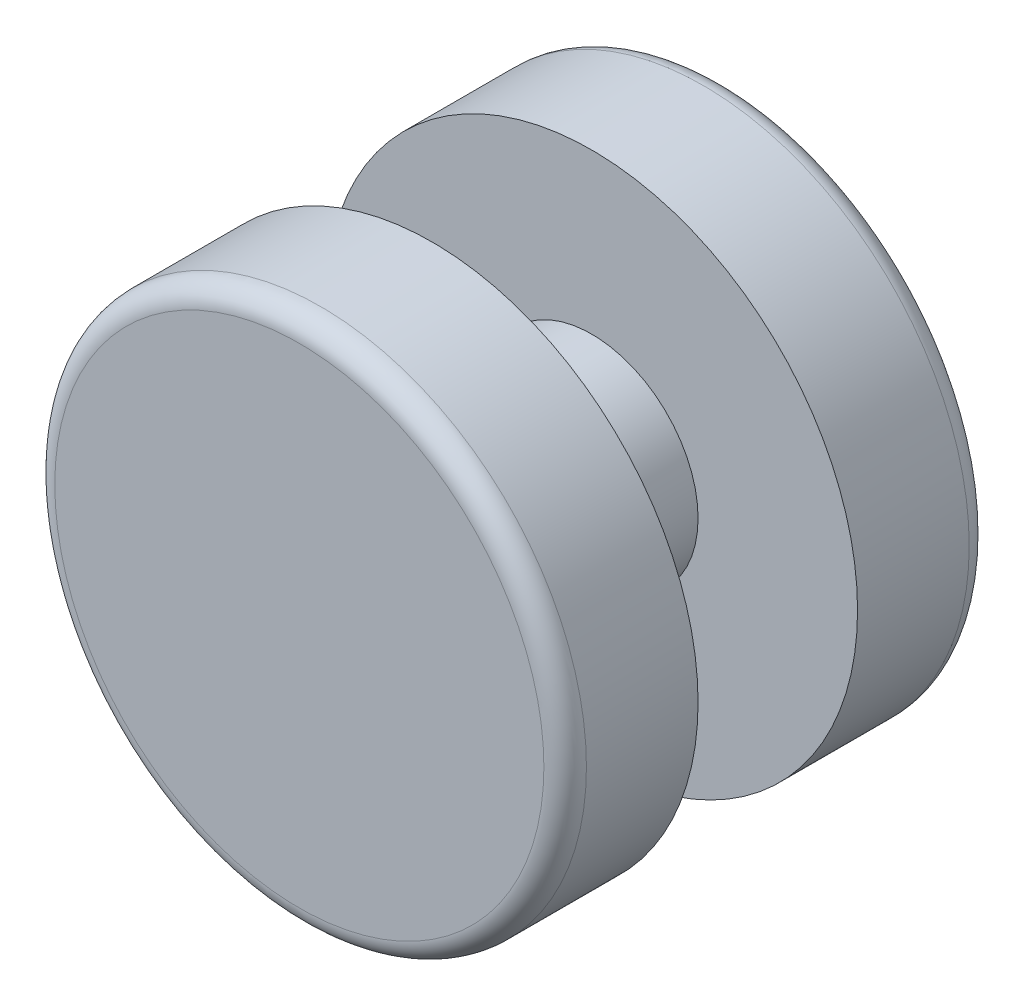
ISO-10303-21;
HEADER;
FILE_DESCRIPTION(('STEP AP214'),'2;1');
FILE_NAME('part.step','',(''),(''),'','','');
FILE_SCHEMA(('AUTOMOTIVE_DESIGN { 1 0 10303 214 1 1 1 1 }'));
ENDSEC;
DATA;
#1=APPLICATION_CONTEXT('core data for automotive mechanical design processes');
#2=APPLICATION_PROTOCOL_DEFINITION('international standard','automotive_design',2000,#1);
#3=PRODUCT_CONTEXT('',#1,'mechanical');
#4=PRODUCT('Part','Part','',(#3));
#5=PRODUCT_RELATED_PRODUCT_CATEGORY('part','',(#4));
#6=PRODUCT_DEFINITION_FORMATION('','',#4);
#7=PRODUCT_DEFINITION_CONTEXT('part definition',#1,'design');
#8=PRODUCT_DEFINITION('design','',#6,#7);
#9=PRODUCT_DEFINITION_SHAPE('','',#8);
#10=(LENGTH_UNIT() NAMED_UNIT(*) SI_UNIT(.MILLI.,.METRE.));
#11=(NAMED_UNIT(*) PLANE_ANGLE_UNIT() SI_UNIT($,.RADIAN.));
#12=(NAMED_UNIT(*) SI_UNIT($,.STERADIAN.) SOLID_ANGLE_UNIT());
#13=UNCERTAINTY_MEASURE_WITH_UNIT(LENGTH_MEASURE(1.E-05),#10,'distance_accuracy_value','');
#14=(GEOMETRIC_REPRESENTATION_CONTEXT(3) GLOBAL_UNCERTAINTY_ASSIGNED_CONTEXT((#13)) GLOBAL_UNIT_ASSIGNED_CONTEXT((#10,
#11,#12)) REPRESENTATION_CONTEXT('',''));
#15=CARTESIAN_POINT('',(0.,0.,0.));
#16=DIRECTION('',(0.,0.,1.));
#17=DIRECTION('',(1.,0.,0.));
#18=AXIS2_PLACEMENT_3D('',#15,#16,#17);
#19=CARTESIAN_POINT('',(0.,0.,2.));
#20=DIRECTION('',(0.,0.,-1.));
#21=DIRECTION('',(-1.,0.,0.));
#22=AXIS2_PLACEMENT_3D('',#19,#20,#21);
#23=CYLINDRICAL_SURFACE('',#22,2.5);
#24=CARTESIAN_POINT('',(0.,0.,-1.8));
#25=DIRECTION('',(0.,0.,1.));
#26=DIRECTION('',(1.,0.,0.));
#27=AXIS2_PLACEMENT_3D('',#24,#25,#26);
#28=CIRCLE('',#27,2.5);
#29=CARTESIAN_POINT('',(2.5,0.,-1.8));
#30=VERTEX_POINT('',#29);
#31=EDGE_CURVE('E34',#30,#30,#28,.T.);
#32=ORIENTED_EDGE('',*,*,#31,.T.);
#33=EDGE_LOOP('',(#32));
#34=FACE_BOUND('',#33,.T.);
#35=CARTESIAN_POINT('',(0.,0.,-0.75));
#36=DIRECTION('',(0.,0.,1.));
#37=DIRECTION('',(1.,0.,0.));
#38=AXIS2_PLACEMENT_3D('',#35,#36,#37);
#39=CIRCLE('',#38,2.5);
#40=CARTESIAN_POINT('',(2.5,0.,-0.75));
#41=VERTEX_POINT('',#40);
#42=EDGE_CURVE('E47',#41,#41,#39,.T.);
#43=ORIENTED_EDGE('',*,*,#42,.F.);
#44=EDGE_LOOP('',(#43));
#45=FACE_BOUND('',#44,.T.);
#46=ADVANCED_FACE('F27',(#34,#45),#23,.T.);
#47=CARTESIAN_POINT('',(0.,0.,-2.));
#48=DIRECTION('',(0.,0.,1.));
#49=DIRECTION('',(1.,0.,0.));
#50=AXIS2_PLACEMENT_3D('',#47,#48,#49);
#51=PLANE('',#50);
#52=CARTESIAN_POINT('',(0.,0.,-2.));
#53=DIRECTION('',(0.,0.,1.));
#54=DIRECTION('',(1.,0.,0.));
#55=AXIS2_PLACEMENT_3D('',#52,#53,#54);
#56=CIRCLE('',#55,2.3);
#57=CARTESIAN_POINT('',(2.3,0.,-2.));
#58=VERTEX_POINT('',#57);
#59=EDGE_CURVE('E10',#58,#58,#56,.F.);
#60=ORIENTED_EDGE('',*,*,#59,.T.);
#61=EDGE_LOOP('',(#60));
#62=FACE_BOUND('',#61,.T.);
#63=ADVANCED_FACE('F77',(#62),#51,.F.);
#64=CARTESIAN_POINT('',(0.,0.,-0.75));
#65=DIRECTION('',(0.,0.,1.));
#66=DIRECTION('',(1.,0.,0.));
#67=AXIS2_PLACEMENT_3D('',#64,#65,#66);
#68=PLANE('',#67);
#69=CARTESIAN_POINT('',(0.,0.,-0.75));
#70=DIRECTION('',(0.,0.,1.));
#71=DIRECTION('',(1.,0.,0.));
#72=AXIS2_PLACEMENT_3D('',#69,#70,#71);
#73=CIRCLE('',#72,0.999999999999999);
#74=CARTESIAN_POINT('',(0.999999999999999,0.,-0.75));
#75=VERTEX_POINT('',#74);
#76=EDGE_CURVE('E53',#75,#75,#73,.T.);
#77=ORIENTED_EDGE('',*,*,#76,.F.);
#78=EDGE_LOOP('',(#77));
#79=FACE_BOUND('',#78,.T.);
#80=ORIENTED_EDGE('',*,*,#42,.T.);
#81=EDGE_LOOP('',(#80));
#82=FACE_BOUND('',#81,.T.);
#83=ADVANCED_FACE('F73',(#79,#82),#68,.T.);
#84=CARTESIAN_POINT('',(0.,0.,0.75));
#85=DIRECTION('',(0.,0.,1.));
#86=DIRECTION('',(1.,0.,0.));
#87=AXIS2_PLACEMENT_3D('',#84,#85,#86);
#88=PLANE('',#87);
#89=CARTESIAN_POINT('',(0.,0.,0.75));
#90=DIRECTION('',(0.,0.,1.));
#91=DIRECTION('',(1.,0.,0.));
#92=AXIS2_PLACEMENT_3D('',#89,#90,#91);
#93=CIRCLE('',#92,0.999999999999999);
#94=CARTESIAN_POINT('',(0.999999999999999,0.,0.75));
#95=VERTEX_POINT('',#94);
#96=EDGE_CURVE('E56',#95,#95,#93,.T.);
#97=ORIENTED_EDGE('',*,*,#96,.T.);
#98=EDGE_LOOP('',(#97));
#99=FACE_BOUND('',#98,.T.);
#100=CARTESIAN_POINT('',(0.,0.,0.75));
#101=DIRECTION('',(0.,0.,1.));
#102=DIRECTION('',(1.,0.,0.));
#103=AXIS2_PLACEMENT_3D('',#100,#101,#102);
#104=CIRCLE('',#103,2.5);
#105=CARTESIAN_POINT('',(2.5,0.,0.75));
#106=VERTEX_POINT('',#105);
#107=EDGE_CURVE('E50',#106,#106,#104,.T.);
#108=ORIENTED_EDGE('',*,*,#107,.F.);
#109=EDGE_LOOP('',(#108));
#110=FACE_BOUND('',#109,.T.);
#111=ADVANCED_FACE('F60',(#99,#110),#88,.F.);
#112=CARTESIAN_POINT('',(0.,0.,-0.75));
#113=DIRECTION('',(0.,0.,1.));
#114=DIRECTION('',(1.,0.,0.));
#115=AXIS2_PLACEMENT_3D('',#112,#113,#114);
#116=CYLINDRICAL_SURFACE('',#115,0.999999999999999);
#117=ORIENTED_EDGE('',*,*,#76,.T.);
#118=EDGE_LOOP('',(#117));
#119=FACE_BOUND('',#118,.T.);
#120=ORIENTED_EDGE('',*,*,#96,.F.);
#121=EDGE_LOOP('',(#120));
#122=FACE_BOUND('',#121,.T.);
#123=ADVANCED_FACE('F63',(#119,#122),#116,.T.);
#124=CARTESIAN_POINT('',(0.,0.,2.));
#125=DIRECTION('',(0.,0.,1.));
#126=DIRECTION('',(1.,0.,0.));
#127=AXIS2_PLACEMENT_3D('',#124,#125,#126);
#128=PLANE('',#127);
#129=CARTESIAN_POINT('',(0.,0.,2.));
#130=DIRECTION('',(0.,0.,1.));
#131=DIRECTION('',(1.,0.,0.));
#132=AXIS2_PLACEMENT_3D('',#129,#130,#131);
#133=CIRCLE('',#132,2.3);
#134=CARTESIAN_POINT('',(2.3,0.,2.));
#135=VERTEX_POINT('',#134);
#136=EDGE_CURVE('E42',#135,#135,#133,.T.);
#137=ORIENTED_EDGE('',*,*,#136,.T.);
#138=EDGE_LOOP('',(#137));
#139=FACE_BOUND('',#138,.T.);
#140=ADVANCED_FACE('F65',(#139),#128,.T.);
#141=CARTESIAN_POINT('',(0.,0.,1.8));
#142=DIRECTION('',(0.,0.,1.));
#143=DIRECTION('',(1.,0.,0.));
#144=AXIS2_PLACEMENT_3D('',#141,#142,#143);
#145=CIRCLE('',#144,2.5);
#146=CARTESIAN_POINT('',(2.5,0.,1.8));
#147=VERTEX_POINT('',#146);
#148=EDGE_CURVE('E38',#147,#147,#145,.F.);
#149=ORIENTED_EDGE('',*,*,#148,.T.);
#150=EDGE_LOOP('',(#149));
#151=FACE_BOUND('',#150,.T.);
#152=ORIENTED_EDGE('',*,*,#107,.T.);
#153=EDGE_LOOP('',(#152));
#154=FACE_BOUND('',#153,.T.);
#155=ADVANCED_FACE('F29',(#151,#154),#23,.T.);
#156=CARTESIAN_POINT('',(0.,0.,1.8));
#157=DIRECTION('',(0.,0.,1.));
#158=DIRECTION('',(1.,0.,0.));
#159=AXIS2_PLACEMENT_3D('',#156,#157,#158);
#160=TOROIDAL_SURFACE('',#159,2.3,0.2);
#161=ORIENTED_EDGE('',*,*,#148,.F.);
#162=EDGE_LOOP('',(#161));
#163=FACE_BOUND('',#162,.T.);
#164=ORIENTED_EDGE('',*,*,#136,.F.);
#165=EDGE_LOOP('',(#164));
#166=FACE_BOUND('',#165,.T.);
#167=ADVANCED_FACE('F84',(#163,#166),#160,.T.);
#168=CARTESIAN_POINT('',(0.,0.,-1.8));
#169=DIRECTION('',(0.,0.,1.));
#170=DIRECTION('',(1.,0.,0.));
#171=AXIS2_PLACEMENT_3D('',#168,#169,#170);
#172=TOROIDAL_SURFACE('',#171,2.3,0.2);
#173=ORIENTED_EDGE('',*,*,#59,.F.);
#174=EDGE_LOOP('',(#173));
#175=FACE_BOUND('',#174,.T.);
#176=ORIENTED_EDGE('',*,*,#31,.F.);
#177=EDGE_LOOP('',(#176));
#178=FACE_BOUND('',#177,.T.);
#179=ADVANCED_FACE('F89',(#175,#178),#172,.T.);
#180=CLOSED_SHELL('',(#46,#63,#83,#111,#123,#140,#155,#167,#179));
#181=MANIFOLD_SOLID_BREP('B2',#180);
#182=ADVANCED_BREP_SHAPE_REPRESENTATION('',(#18,#181),#14);
#183=SHAPE_DEFINITION_REPRESENTATION(#9,#182);
ENDSEC;
END-ISO-10303-21;
